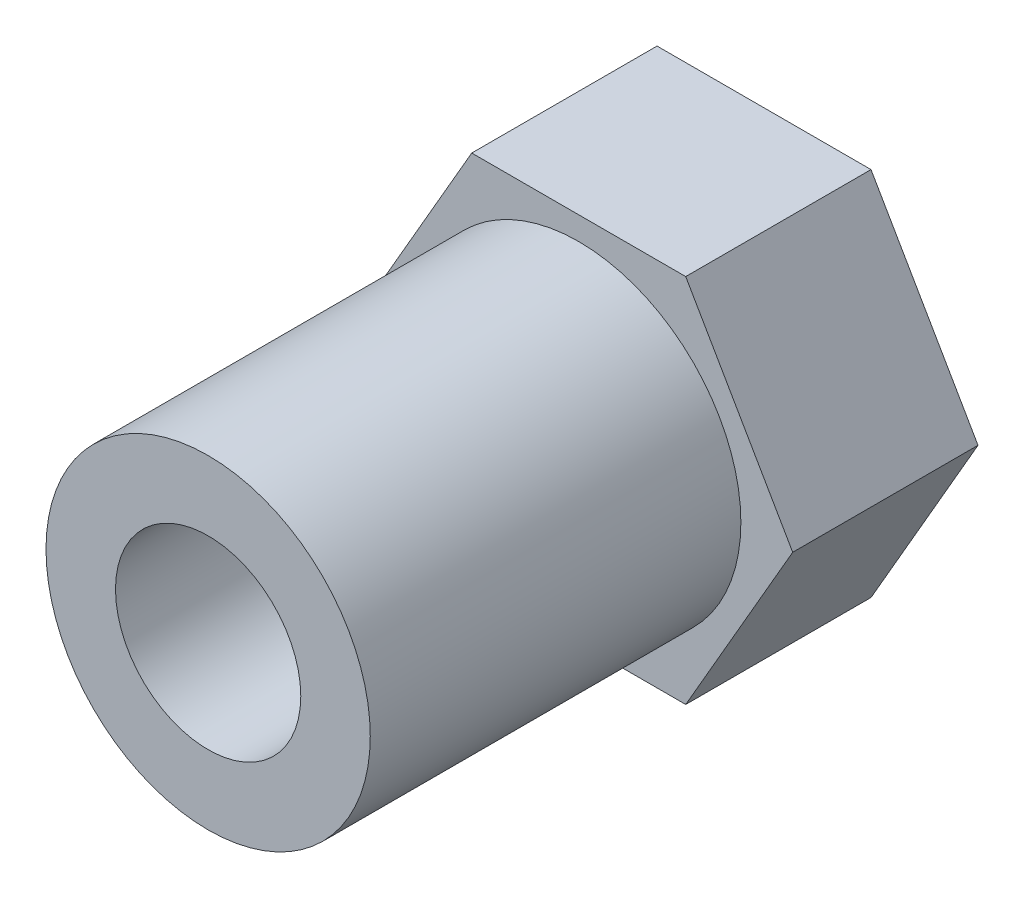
from build123d import *

# Parameters (mm, degrees)
EXTRUDE_1_DEPTH     = 6
SKETCH_2_R          = 5.25
EXTRUDE_2_DEPTH     = 12
SKETCH_3_R          = 3
CUT_EXTRUDE_1_DEPTH = 12
SKETCH_5_R          = 2
CUT_EXTRUDE_2_DEPTH = 10


with BuildPart() as part:
    # Sketch 1 → Extrude 1 (new body)
    with BuildSketch(Plane.XY):
        Polygon((6.92820323, 0), (3.464101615, 6), (-3.464101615, 6), (-6.92820323, 0), (-3.464101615, -6), (3.464101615, -6), align=None)
    extrude(amount=EXTRUDE_1_DEPTH)

    # Sketch 2 → Extrude 2 (add)
    with BuildSketch(Plane.XY.offset(6)):
        Circle(SKETCH_2_R)
    extrude(amount=EXTRUDE_2_DEPTH)

    # Sketch 3 → Cut-Extrude 1 (cut)
    with BuildSketch(Plane.XY.offset(18)):
        Circle(SKETCH_3_R)
    extrude(amount=-CUT_EXTRUDE_1_DEPTH, mode=Mode.SUBTRACT)

    # Sketch 5 → Cut-Extrude 2 (cut)
    with BuildSketch(Plane.XY.offset(6)):
        Circle(SKETCH_5_R)
    extrude(amount=-CUT_EXTRUDE_2_DEPTH, mode=Mode.SUBTRACT)


solid = part.part
